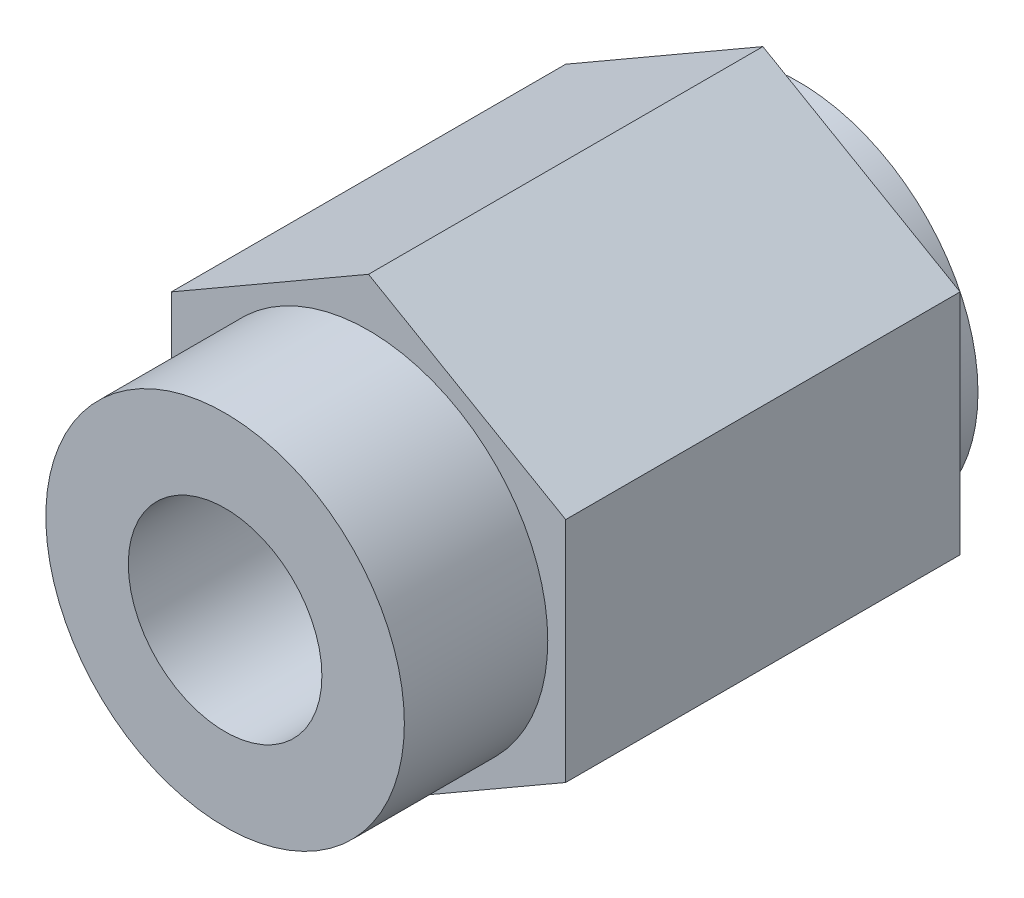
from build123d import *

# Parameters (mm, degrees)
EXTRUDE_1_DEPTH     = 55
SKETCH_2_R          = 25
EXTRUDE_2_DEPTH     = 20
EXTRUDE_START       = 5
SKETCH_3_R          = 25
EXTRUDE_3_DEPTH     = 5
SKETCH_4_R          = 10
CUT_EXTRUDE_1_DEPTH = 40
SKETCH_5_R          = 13.5
CUT_EXTRUDE_2_DEPTH = 40


with BuildPart() as part:
    # Sketch 1 → Extrude 1 (new body)
    with BuildSketch(Plane.XY):
        Polygon((0, 31.754264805), (-27.5, 15.877132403), (-27.5, -15.877132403), (0, -31.754264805), (27.5, -15.877132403), (27.5, 15.877132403), align=None)
    extrude(amount=EXTRUDE_1_DEPTH)

    # Sketch 2 → Extrude 2 (add)
    with BuildSketch(Plane.XY.offset(55)):
        Circle(SKETCH_2_R)
    extrude(amount=EXTRUDE_2_DEPTH)

    # Sketch 3 → Extrude 3 (add)
    with BuildSketch(Plane(origin=(0, 0, 0), x_dir=(-1, 0, 0), z_dir=(0, 0, -1)).offset(EXTRUDE_START)):
        with Locations(Location((0, 0, 0), (0, 0, 180))):
            Circle(SKETCH_3_R)
    extrude(amount=-EXTRUDE_3_DEPTH)

    # Sketch 4 → Cut-Extrude 1 (cut)
    with BuildSketch(Plane(origin=(0, 0, -5), x_dir=(-1, 0, 0), z_dir=(0, 0, -1))):
        Circle(SKETCH_4_R)
    extrude(amount=-CUT_EXTRUDE_1_DEPTH, mode=Mode.SUBTRACT)

    # Sketch 5 → Cut-Extrude 2 (cut)
    with BuildSketch(Plane.XY.offset(75)):
        Circle(SKETCH_5_R)
    extrude(amount=-CUT_EXTRUDE_2_DEPTH, mode=Mode.SUBTRACT)


solid = part.part
